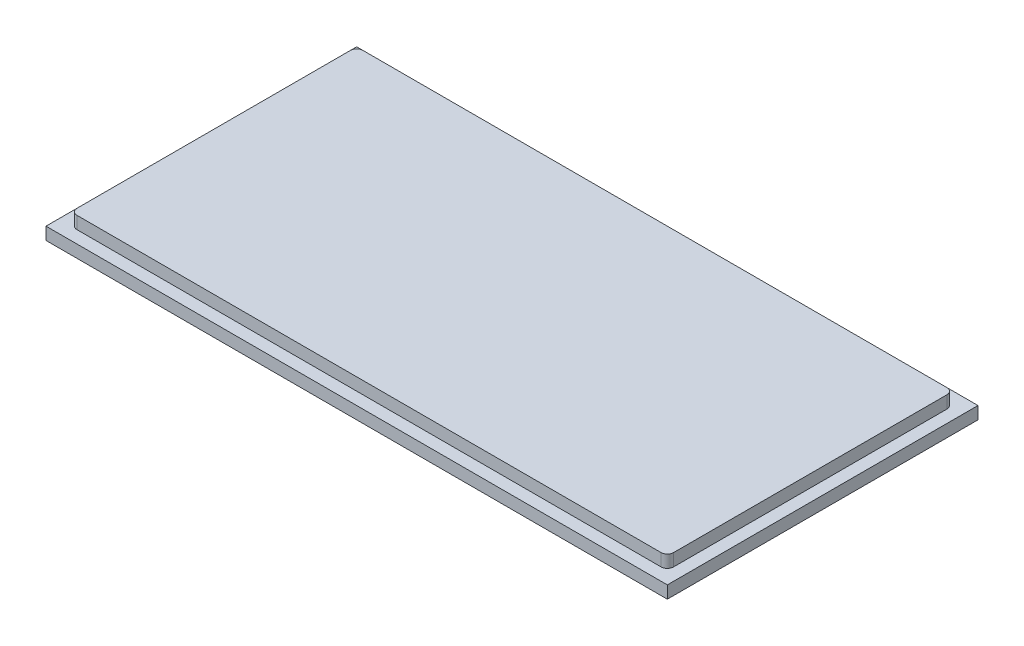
from build123d import *

# Parameters (mm, degrees)
SKETCH1_W           = 127
SKETCH1_H           = 63.5
BOSS_EXTRUDE1_DEPTH = 2.54
BOSS_EXTRUDE2_DEPTH = 2.54


with BuildPart() as part:
    # Sketch1 → Boss-Extrude1 (new body)
    with BuildSketch(Plane(origin=(0, 0, 0), x_dir=(1, 0, 0), z_dir=(0, 1, 0))):
        with Locations((63.5, 31.75)):
            Rectangle(SKETCH1_W, SKETCH1_H)
    extrude(amount=BOSS_EXTRUDE1_DEPTH)

    # Sketch2 → Boss-Extrude2 (add)
    with BuildSketch(Plane(origin=(0, 2.54, 0), x_dir=(1, 0, 0), z_dir=(0, 1, 0))):
        with BuildLine():
            Line((124.46, 3.81), (124.46, 59.69))
            ThreePointArc((124.46, 59.69), (124.088025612, 60.588025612), (123.19, 60.96))
            Line((123.19, 60.96), (3.81, 60.96))
            ThreePointArc((3.81, 60.96), (2.911974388, 60.588025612), (2.54, 59.69))
            Line((2.54, 59.69), (2.54, 3.81))
            ThreePointArc((2.54, 3.81), (2.911974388, 2.911974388), (3.81, 2.54))
            Line((3.81, 2.54), (123.19, 2.54))
            ThreePointArc((123.19, 2.54), (124.088025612, 2.911974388), (124.46, 3.81))
        make_face()
    extrude(amount=BOSS_EXTRUDE2_DEPTH)


solid = part.part
